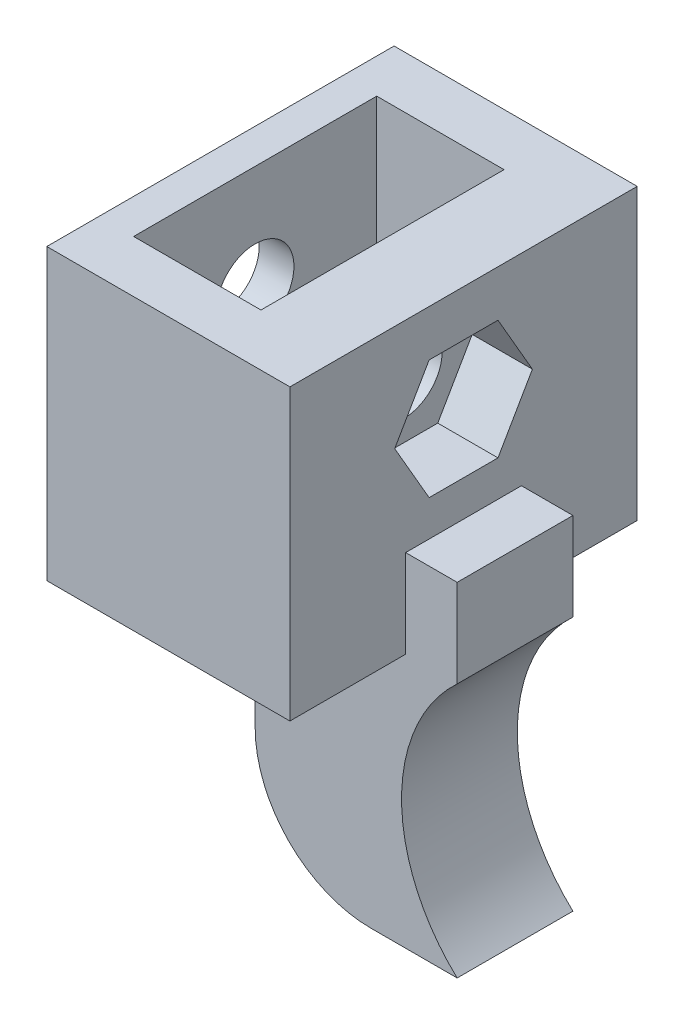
ISO-10303-21;
HEADER;
FILE_DESCRIPTION(('STEP AP214'),'2;1');
FILE_NAME('part.step','',(''),(''),'','','');
FILE_SCHEMA(('AUTOMOTIVE_DESIGN { 1 0 10303 214 1 1 1 1 }'));
ENDSEC;
DATA;
#1=APPLICATION_CONTEXT('core data for automotive mechanical design processes');
#2=APPLICATION_PROTOCOL_DEFINITION('international standard','automotive_design',2000,#1);
#3=PRODUCT_CONTEXT('',#1,'mechanical');
#4=PRODUCT('Part','Part','',(#3));
#5=PRODUCT_RELATED_PRODUCT_CATEGORY('part','',(#4));
#6=PRODUCT_DEFINITION_FORMATION('','',#4);
#7=PRODUCT_DEFINITION_CONTEXT('part definition',#1,'design');
#8=PRODUCT_DEFINITION('design','',#6,#7);
#9=PRODUCT_DEFINITION_SHAPE('','',#8);
#10=(LENGTH_UNIT() NAMED_UNIT(*) SI_UNIT(.MILLI.,.METRE.));
#11=(NAMED_UNIT(*) PLANE_ANGLE_UNIT() SI_UNIT($,.RADIAN.));
#12=(NAMED_UNIT(*) SI_UNIT($,.STERADIAN.) SOLID_ANGLE_UNIT());
#13=UNCERTAINTY_MEASURE_WITH_UNIT(LENGTH_MEASURE(1.E-05),#10,'distance_accuracy_value','');
#14=(GEOMETRIC_REPRESENTATION_CONTEXT(3) GLOBAL_UNCERTAINTY_ASSIGNED_CONTEXT((#13)) GLOBAL_UNIT_ASSIGNED_CONTEXT((#10,
#11,#12)) REPRESENTATION_CONTEXT('',''));
#15=CARTESIAN_POINT('',(0.,0.,0.));
#16=DIRECTION('',(0.,0.,1.));
#17=DIRECTION('',(1.,0.,0.));
#18=AXIS2_PLACEMENT_3D('',#15,#16,#17);
#19=CARTESIAN_POINT('',(-33.,-21.3245016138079,0.));
#20=DIRECTION('',(1.,0.,0.));
#21=DIRECTION('',(0.,0.,-1.));
#22=AXIS2_PLACEMENT_3D('',#19,#20,#21);
#23=CYLINDRICAL_SURFACE('',#22,3.35);
#24=CARTESIAN_POINT('',(-19.,-21.3245016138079,0.));
#25=DIRECTION('',(-1.,0.,0.));
#26=DIRECTION('',(0.,0.,1.));
#27=AXIS2_PLACEMENT_3D('',#24,#25,#26);
#28=CIRCLE('',#27,3.35);
#29=CARTESIAN_POINT('',(-19.,-21.3245016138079,3.35));
#30=VERTEX_POINT('',#29);
#31=EDGE_CURVE('E230',#30,#30,#28,.T.);
#32=ORIENTED_EDGE('',*,*,#31,.T.);
#33=EDGE_LOOP('',(#32));
#34=FACE_BOUND('',#33,.T.);
#35=CARTESIAN_POINT('',(-17.2,-21.3245016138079,0.));
#36=DIRECTION('',(1.,0.,0.));
#37=DIRECTION('',(0.,0.,-1.));
#38=AXIS2_PLACEMENT_3D('',#35,#36,#37);
#39=CIRCLE('',#38,3.35);
#40=CARTESIAN_POINT('',(-17.2,-21.3245016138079,-3.35));
#41=VERTEX_POINT('',#40);
#42=EDGE_CURVE('E40',#41,#41,#39,.F.);
#43=ORIENTED_EDGE('',*,*,#42,.F.);
#44=EDGE_LOOP('',(#43));
#45=FACE_BOUND('',#44,.T.);
#46=ADVANCED_FACE('F36',(#34,#45),#23,.F.);
#47=CARTESIAN_POINT('',(-15.,-49.1745016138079,-15.));
#48=DIRECTION('',(0.,0.,-1.));
#49=DIRECTION('',(-1.,0.,0.));
#50=AXIS2_PLACEMENT_3D('',#47,#48,#49);
#51=PLANE('',#50);
#52=DIRECTION('',(0.,1.,0.));
#53=VECTOR('',#52,1.);
#54=CARTESIAN_POINT('',(-12.,-12.1745016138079,-15.));
#55=LINE('',#54,#53);
#56=CARTESIAN_POINT('',(-12.,-37.1745016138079,-15.));
#57=VERTEX_POINT('',#56);
#58=CARTESIAN_POINT('',(-12.,-12.1745016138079,-15.));
#59=VERTEX_POINT('',#58);
#60=EDGE_CURVE('E307',#57,#59,#55,.T.);
#61=ORIENTED_EDGE('',*,*,#60,.F.);
#62=DIRECTION('',(1.,0.,0.));
#63=VECTOR('',#62,1.);
#64=CARTESIAN_POINT('',(-33.,-37.1745016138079,-15.));
#65=LINE('',#64,#63);
#66=CARTESIAN_POINT('',(-33.,-37.1745016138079,-15.));
#67=VERTEX_POINT('',#66);
#68=EDGE_CURVE('E303',#67,#57,#65,.T.);
#69=ORIENTED_EDGE('',*,*,#68,.F.);
#70=DIRECTION('',(0.,-1.,0.));
#71=VECTOR('',#70,1.);
#72=CARTESIAN_POINT('',(-33.,-12.1745016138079,-15.));
#73=LINE('',#72,#71);
#74=CARTESIAN_POINT('',(-33.,-12.1745016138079,-15.));
#75=VERTEX_POINT('',#74);
#76=EDGE_CURVE('E300',#75,#67,#73,.T.);
#77=ORIENTED_EDGE('',*,*,#76,.F.);
#78=DIRECTION('',(-1.,0.,0.));
#79=VECTOR('',#78,1.);
#80=CARTESIAN_POINT('',(-33.,-12.1745016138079,-15.));
#81=LINE('',#80,#79);
#82=EDGE_CURVE('E229',#59,#75,#81,.T.);
#83=ORIENTED_EDGE('',*,*,#82,.F.);
#84=EDGE_LOOP('',(#61,#69,#77,#83));
#85=FACE_BOUND('',#84,.T.);
#86=ADVANCED_FACE('F423',(#85),#51,.T.);
#87=CARTESIAN_POINT('',(-15.,-49.1745016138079,15.));
#88=DIRECTION('',(0.,0.,-1.));
#89=DIRECTION('',(-1.,0.,0.));
#90=AXIS2_PLACEMENT_3D('',#87,#88,#89);
#91=PLANE('',#90);
#92=DIRECTION('',(1.,0.,0.));
#93=VECTOR('',#92,1.);
#94=CARTESIAN_POINT('',(-33.,-37.1745016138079,15.));
#95=LINE('',#94,#93);
#96=CARTESIAN_POINT('',(-33.,-37.1745016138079,15.));
#97=VERTEX_POINT('',#96);
#98=CARTESIAN_POINT('',(-12.,-37.1745016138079,15.));
#99=VERTEX_POINT('',#98);
#100=EDGE_CURVE('E314',#97,#99,#95,.T.);
#101=ORIENTED_EDGE('',*,*,#100,.T.);
#102=DIRECTION('',(0.,1.,0.));
#103=VECTOR('',#102,1.);
#104=CARTESIAN_POINT('',(-12.,-12.1745016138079,15.));
#105=LINE('',#104,#103);
#106=CARTESIAN_POINT('',(-12.,-12.1745016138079,15.));
#107=VERTEX_POINT('',#106);
#108=EDGE_CURVE('E317',#99,#107,#105,.T.);
#109=ORIENTED_EDGE('',*,*,#108,.T.);
#110=DIRECTION('',(-1.,0.,0.));
#111=VECTOR('',#110,1.);
#112=CARTESIAN_POINT('',(-33.,-12.1745016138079,15.));
#113=LINE('',#112,#111);
#114=CARTESIAN_POINT('',(-33.,-12.1745016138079,15.));
#115=VERTEX_POINT('',#114);
#116=EDGE_CURVE('E304',#107,#115,#113,.T.);
#117=ORIENTED_EDGE('',*,*,#116,.T.);
#118=DIRECTION('',(0.,-1.,0.));
#119=VECTOR('',#118,1.);
#120=CARTESIAN_POINT('',(-33.,-12.1745016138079,15.));
#121=LINE('',#120,#119);
#122=EDGE_CURVE('E293',#115,#97,#121,.T.);
#123=ORIENTED_EDGE('',*,*,#122,.T.);
#124=EDGE_LOOP('',(#101,#109,#117,#123));
#125=FACE_BOUND('',#124,.T.);
#126=ADVANCED_FACE('F329',(#125),#91,.F.);
#127=CARTESIAN_POINT('',(-33.,-12.1745016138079,-15.));
#128=DIRECTION('',(-1.,0.,0.));
#129=DIRECTION('',(0.,-1.,0.));
#130=AXIS2_PLACEMENT_3D('',#127,#128,#129);
#131=PLANE('',#130);
#132=CARTESIAN_POINT('',(-33.,-21.3245016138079,0.));
#133=DIRECTION('',(1.,0.,0.));
#134=DIRECTION('',(0.,0.,-1.));
#135=AXIS2_PLACEMENT_3D('',#132,#133,#134);
#136=CIRCLE('',#135,3.35);
#137=CARTESIAN_POINT('',(-33.,-21.3245016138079,-3.35));
#138=VERTEX_POINT('',#137);
#139=EDGE_CURVE('E233',#138,#138,#136,.T.);
#140=ORIENTED_EDGE('',*,*,#139,.T.);
#141=EDGE_LOOP('',(#140));
#142=FACE_BOUND('',#141,.T.);
#143=ORIENTED_EDGE('',*,*,#122,.F.);
#144=DIRECTION('',(0.,0.,1.));
#145=VECTOR('',#144,1.);
#146=CARTESIAN_POINT('',(-33.,-12.1745016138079,-15.));
#147=LINE('',#146,#145);
#148=EDGE_CURVE('E11',#75,#115,#147,.T.);
#149=ORIENTED_EDGE('',*,*,#148,.F.);
#150=ORIENTED_EDGE('',*,*,#76,.T.);
#151=DIRECTION('',(0.,0.,1.));
#152=VECTOR('',#151,1.);
#153=CARTESIAN_POINT('',(-33.,-37.1745016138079,-15.));
#154=LINE('',#153,#152);
#155=EDGE_CURVE('E228',#67,#97,#154,.T.);
#156=ORIENTED_EDGE('',*,*,#155,.T.);
#157=EDGE_LOOP('',(#143,#149,#150,#156));
#158=FACE_BOUND('',#157,.T.);
#159=ADVANCED_FACE('F38',(#142,#158),#131,.T.);
#160=CARTESIAN_POINT('',(-33.,-12.1745016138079,-15.));
#161=DIRECTION('',(0.,1.,0.));
#162=DIRECTION('',(0.,0.,1.));
#163=AXIS2_PLACEMENT_3D('',#160,#161,#162);
#164=PLANE('',#163);
#165=DIRECTION('',(1.,0.,0.));
#166=VECTOR('',#165,1.);
#167=CARTESIAN_POINT('',(-30.,-12.1745016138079,10.5));
#168=LINE('',#167,#166);
#169=CARTESIAN_POINT('',(-30.,-12.1745016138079,10.5));
#170=VERTEX_POINT('',#169);
#171=CARTESIAN_POINT('',(-19.,-12.1745016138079,10.5));
#172=VERTEX_POINT('',#171);
#173=EDGE_CURVE('E269',#170,#172,#168,.T.);
#174=ORIENTED_EDGE('',*,*,#173,.F.);
#175=DIRECTION('',(0.,0.,1.));
#176=VECTOR('',#175,1.);
#177=CARTESIAN_POINT('',(-30.,-12.1745016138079,-10.5));
#178=LINE('',#177,#176);
#179=CARTESIAN_POINT('',(-30.,-12.1745016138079,-10.5));
#180=VERTEX_POINT('',#179);
#181=EDGE_CURVE('E274',#180,#170,#178,.T.);
#182=ORIENTED_EDGE('',*,*,#181,.F.);
#183=DIRECTION('',(1.,0.,0.));
#184=VECTOR('',#183,1.);
#185=CARTESIAN_POINT('',(-30.,-12.1745016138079,-10.5));
#186=LINE('',#185,#184);
#187=CARTESIAN_POINT('',(-19.,-12.1745016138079,-10.5));
#188=VERTEX_POINT('',#187);
#189=EDGE_CURVE('E286',#180,#188,#186,.T.);
#190=ORIENTED_EDGE('',*,*,#189,.T.);
#191=DIRECTION('',(0.,0.,1.));
#192=VECTOR('',#191,1.);
#193=CARTESIAN_POINT('',(-19.,-12.1745016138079,-10.5));
#194=LINE('',#193,#192);
#195=EDGE_CURVE('E283',#188,#172,#194,.T.);
#196=ORIENTED_EDGE('',*,*,#195,.T.);
#197=EDGE_LOOP('',(#174,#182,#190,#196));
#198=FACE_BOUND('',#197,.T.);
#199=ORIENTED_EDGE('',*,*,#116,.F.);
#200=DIRECTION('',(0.,0.,1.));
#201=VECTOR('',#200,1.);
#202=CARTESIAN_POINT('',(-12.,-12.1745016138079,-15.));
#203=LINE('',#202,#201);
#204=EDGE_CURVE('E45',#59,#107,#203,.T.);
#205=ORIENTED_EDGE('',*,*,#204,.F.);
#206=ORIENTED_EDGE('',*,*,#82,.T.);
#207=ORIENTED_EDGE('',*,*,#148,.T.);
#208=EDGE_LOOP('',(#199,#205,#206,#207));
#209=FACE_BOUND('',#208,.T.);
#210=ADVANCED_FACE('F331',(#198,#209),#164,.T.);
#211=CARTESIAN_POINT('',(-12.,-12.1745016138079,-15.));
#212=DIRECTION('',(1.,0.,0.));
#213=DIRECTION('',(0.,0.,-1.));
#214=AXIS2_PLACEMENT_3D('',#211,#212,#213);
#215=PLANE('',#214);
#216=DIRECTION('',(0.,0.866025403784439,-0.5));
#217=VECTOR('',#216,1.);
#218=CARTESIAN_POINT('',(-12.,-26.4745016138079,-2.97335388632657));
#219=LINE('',#218,#217);
#220=CARTESIAN_POINT('',(-12.,-26.4745016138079,-2.97335388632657));
#221=VERTEX_POINT('',#220);
#222=CARTESIAN_POINT('',(-12.,-21.3245016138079,-5.94670777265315));
#223=VERTEX_POINT('',#222);
#224=EDGE_CURVE('E61',#221,#223,#219,.T.);
#225=ORIENTED_EDGE('',*,*,#224,.F.);
#226=DIRECTION('',(0.,0.,-1.));
#227=VECTOR('',#226,1.);
#228=CARTESIAN_POINT('',(-12.,-26.4745016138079,2.97335388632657));
#229=LINE('',#228,#227);
#230=CARTESIAN_POINT('',(-12.,-26.4745016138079,2.97335388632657));
#231=VERTEX_POINT('',#230);
#232=EDGE_CURVE('E351',#231,#221,#229,.T.);
#233=ORIENTED_EDGE('',*,*,#232,.F.);
#234=DIRECTION('',(0.,-0.866025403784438,-0.5));
#235=VECTOR('',#234,1.);
#236=CARTESIAN_POINT('',(-12.,-21.3245016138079,5.94670777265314));
#237=LINE('',#236,#235);
#238=CARTESIAN_POINT('',(-12.,-21.3245016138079,5.94670777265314));
#239=VERTEX_POINT('',#238);
#240=EDGE_CURVE('E376',#239,#231,#237,.T.);
#241=ORIENTED_EDGE('',*,*,#240,.F.);
#242=DIRECTION('',(0.,-0.866025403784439,0.5));
#243=VECTOR('',#242,1.);
#244=CARTESIAN_POINT('',(-12.,-16.1745016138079,2.97335388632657));
#245=LINE('',#244,#243);
#246=CARTESIAN_POINT('',(-12.,-16.1745016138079,2.97335388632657));
#247=VERTEX_POINT('',#246);
#248=EDGE_CURVE('E373',#247,#239,#245,.T.);
#249=ORIENTED_EDGE('',*,*,#248,.F.);
#250=DIRECTION('',(0.,0.,1.));
#251=VECTOR('',#250,1.);
#252=CARTESIAN_POINT('',(-12.,-16.1745016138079,-2.97335388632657));
#253=LINE('',#252,#251);
#254=CARTESIAN_POINT('',(-12.,-16.1745016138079,-2.97335388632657));
#255=VERTEX_POINT('',#254);
#256=EDGE_CURVE('E370',#255,#247,#253,.T.);
#257=ORIENTED_EDGE('',*,*,#256,.F.);
#258=DIRECTION('',(0.,0.866025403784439,0.5));
#259=VECTOR('',#258,1.);
#260=CARTESIAN_POINT('',(-12.,-21.3245016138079,-5.94670777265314));
#261=LINE('',#260,#259);
#262=EDGE_CURVE('E367',#223,#255,#261,.T.);
#263=ORIENTED_EDGE('',*,*,#262,.F.);
#264=EDGE_LOOP('',(#225,#233,#241,#249,#257,#263));
#265=FACE_BOUND('',#264,.T.);
#266=ORIENTED_EDGE('',*,*,#108,.F.);
#267=DIRECTION('',(0.,0.,1.));
#268=VECTOR('',#267,1.);
#269=CARTESIAN_POINT('',(-12.,-37.1745016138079,15.));
#270=LINE('',#269,#268);
#271=CARTESIAN_POINT('',(-12.,-37.1745016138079,5.));
#272=VERTEX_POINT('',#271);
#273=EDGE_CURVE('E196',#272,#99,#270,.T.);
#274=ORIENTED_EDGE('',*,*,#273,.F.);
#275=DIRECTION('',(0.,1.,0.));
#276=VECTOR('',#275,1.);
#277=CARTESIAN_POINT('',(-12.,-48.1190577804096,5.));
#278=LINE('',#277,#276);
#279=CARTESIAN_POINT('',(-12.,-29.5726790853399,5.));
#280=VERTEX_POINT('',#279);
#281=EDGE_CURVE('E53',#272,#280,#278,.T.);
#282=ORIENTED_EDGE('',*,*,#281,.T.);
#283=DIRECTION('',(0.,0.,1.));
#284=VECTOR('',#283,1.);
#285=CARTESIAN_POINT('',(-12.,-29.5726790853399,-15.));
#286=LINE('',#285,#284);
#287=CARTESIAN_POINT('',(-12.,-29.5726790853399,-5.));
#288=VERTEX_POINT('',#287);
#289=EDGE_CURVE('E210',#288,#280,#286,.T.);
#290=ORIENTED_EDGE('',*,*,#289,.F.);
#291=DIRECTION('',(0.,1.,0.));
#292=VECTOR('',#291,1.);
#293=CARTESIAN_POINT('',(-12.,-48.1190577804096,-5.));
#294=LINE('',#293,#292);
#295=CARTESIAN_POINT('',(-12.,-37.1745016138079,-5.));
#296=VERTEX_POINT('',#295);
#297=EDGE_CURVE('E191',#296,#288,#294,.T.);
#298=ORIENTED_EDGE('',*,*,#297,.F.);
#299=DIRECTION('',(0.,0.,1.));
#300=VECTOR('',#299,1.);
#301=CARTESIAN_POINT('',(-12.,-37.1745016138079,-15.));
#302=LINE('',#301,#300);
#303=EDGE_CURVE('E205',#57,#296,#302,.T.);
#304=ORIENTED_EDGE('',*,*,#303,.F.);
#305=ORIENTED_EDGE('',*,*,#60,.T.);
#306=ORIENTED_EDGE('',*,*,#204,.T.);
#307=EDGE_LOOP('',(#266,#274,#282,#290,#298,#304,#305,#306));
#308=FACE_BOUND('',#307,.T.);
#309=ADVANCED_FACE('F322',(#265,#308),#215,.T.);
#310=CARTESIAN_POINT('',(-12.,-29.5726790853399,-15.));
#311=DIRECTION('',(0.,1.,0.));
#312=DIRECTION('',(0.,0.,1.));
#313=AXIS2_PLACEMENT_3D('',#310,#311,#312);
#314=PLANE('',#313);
#315=DIRECTION('',(1.,0.,0.));
#316=VECTOR('',#315,1.);
#317=CARTESIAN_POINT('',(-12.,-29.5726790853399,-5.));
#318=LINE('',#317,#316);
#319=CARTESIAN_POINT('',(-7.55215673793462,-29.5726790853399,-5.));
#320=VERTEX_POINT('',#319);
#321=EDGE_CURVE('E185',#288,#320,#318,.T.);
#322=ORIENTED_EDGE('',*,*,#321,.F.);
#323=ORIENTED_EDGE('',*,*,#289,.T.);
#324=DIRECTION('',(-1.,0.,0.));
#325=VECTOR('',#324,1.);
#326=CARTESIAN_POINT('',(-12.,-29.5726790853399,5.));
#327=LINE('',#326,#325);
#328=CARTESIAN_POINT('',(-7.55215673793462,-29.5726790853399,5.));
#329=VERTEX_POINT('',#328);
#330=EDGE_CURVE('E209',#329,#280,#327,.T.);
#331=ORIENTED_EDGE('',*,*,#330,.F.);
#332=DIRECTION('',(0.,0.,1.));
#333=VECTOR('',#332,1.);
#334=CARTESIAN_POINT('',(-7.55215673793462,-29.5726790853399,-15.));
#335=LINE('',#334,#333);
#336=EDGE_CURVE('E202',#320,#329,#335,.T.);
#337=ORIENTED_EDGE('',*,*,#336,.F.);
#338=EDGE_LOOP('',(#322,#323,#331,#337));
#339=FACE_BOUND('',#338,.T.);
#340=ADVANCED_FACE('F208',(#339),#314,.T.);
#341=CARTESIAN_POINT('',(-7.55215673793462,-29.5726790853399,-15.));
#342=DIRECTION('',(1.,0.,0.));
#343=DIRECTION('',(0.,0.,-1.));
#344=AXIS2_PLACEMENT_3D('',#341,#342,#343);
#345=PLANE('',#344);
#346=DIRECTION('',(0.,1.,0.));
#347=VECTOR('',#346,1.);
#348=CARTESIAN_POINT('',(-7.55215673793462,-48.1190577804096,-5.));
#349=LINE('',#348,#347);
#350=CARTESIAN_POINT('',(-7.55215673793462,-37.1745016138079,-5.));
#351=VERTEX_POINT('',#350);
#352=EDGE_CURVE('E188',#351,#320,#349,.T.);
#353=ORIENTED_EDGE('',*,*,#352,.T.);
#354=ORIENTED_EDGE('',*,*,#336,.T.);
#355=DIRECTION('',(0.,1.,0.));
#356=VECTOR('',#355,1.);
#357=CARTESIAN_POINT('',(-7.55215673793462,-48.1190577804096,5.));
#358=LINE('',#357,#356);
#359=CARTESIAN_POINT('',(-7.55215673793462,-37.1745016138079,5.));
#360=VERTEX_POINT('',#359);
#361=EDGE_CURVE('E341',#360,#329,#358,.T.);
#362=ORIENTED_EDGE('',*,*,#361,.F.);
#363=DIRECTION('',(0.,0.,1.));
#364=VECTOR('',#363,1.);
#365=CARTESIAN_POINT('',(-7.55215673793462,-37.1745016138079,-15.));
#366=LINE('',#365,#364);
#367=EDGE_CURVE('E204',#351,#360,#366,.T.);
#368=ORIENTED_EDGE('',*,*,#367,.F.);
#369=EDGE_LOOP('',(#353,#354,#362,#368));
#370=FACE_BOUND('',#369,.T.);
#371=ADVANCED_FACE('F201',(#370),#345,.T.);
#372=CARTESIAN_POINT('',(2.64588228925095,-48.1745016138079,-15.));
#373=DIRECTION('',(0.,0.,1.));
#374=DIRECTION('',(1.,0.,0.));
#375=AXIS2_PLACEMENT_3D('',#372,#373,#374);
#376=CYLINDRICAL_SURFACE('',#375,15.);
#377=CARTESIAN_POINT('',(2.64588228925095,-48.1745016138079,5.));
#378=DIRECTION('',(0.,0.,-1.));
#379=DIRECTION('',(-1.,0.,0.));
#380=AXIS2_PLACEMENT_3D('',#377,#378,#379);
#381=CIRCLE('',#380,15.);
#382=CARTESIAN_POINT('',(-7.55215673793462,-59.1745016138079,5.));
#383=VERTEX_POINT('',#382);
#384=EDGE_CURVE('E266',#383,#360,#381,.T.);
#385=ORIENTED_EDGE('',*,*,#384,.F.);
#386=DIRECTION('',(0.,0.,1.));
#387=VECTOR('',#386,1.);
#388=CARTESIAN_POINT('',(-7.55215673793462,-59.1745016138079,-15.));
#389=LINE('',#388,#387);
#390=CARTESIAN_POINT('',(-7.55215673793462,-59.1745016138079,-5.));
#391=VERTEX_POINT('',#390);
#392=EDGE_CURVE('E213',#391,#383,#389,.T.);
#393=ORIENTED_EDGE('',*,*,#392,.F.);
#394=CARTESIAN_POINT('',(2.64588228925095,-48.1745016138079,-5.));
#395=DIRECTION('',(0.,0.,1.));
#396=DIRECTION('',(1.,0.,0.));
#397=AXIS2_PLACEMENT_3D('',#394,#395,#396);
#398=CIRCLE('',#397,15.);
#399=EDGE_CURVE('E260',#351,#391,#398,.T.);
#400=ORIENTED_EDGE('',*,*,#399,.F.);
#401=ORIENTED_EDGE('',*,*,#367,.T.);
#402=EDGE_LOOP('',(#385,#393,#400,#401));
#403=FACE_BOUND('',#402,.T.);
#404=ADVANCED_FACE('F490',(#403),#376,.F.);
#405=CARTESIAN_POINT('',(-15.,-59.1745016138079,-15.));
#406=DIRECTION('',(0.,-1.,0.));
#407=DIRECTION('',(0.,0.,-1.));
#408=AXIS2_PLACEMENT_3D('',#405,#406,#407);
#409=PLANE('',#408);
#410=DIRECTION('',(1.,0.,0.));
#411=VECTOR('',#410,1.);
#412=CARTESIAN_POINT('',(-33.,-59.1745016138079,5.));
#413=LINE('',#412,#411);
#414=CARTESIAN_POINT('',(-15.,-59.1745016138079,5.));
#415=VERTEX_POINT('',#414);
#416=EDGE_CURVE('E249',#415,#383,#413,.T.);
#417=ORIENTED_EDGE('',*,*,#416,.F.);
#418=DIRECTION('',(0.,0.,1.));
#419=VECTOR('',#418,1.);
#420=CARTESIAN_POINT('',(-15.,-59.1745016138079,-15.));
#421=LINE('',#420,#419);
#422=CARTESIAN_POINT('',(-15.,-59.1745016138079,-5.));
#423=VERTEX_POINT('',#422);
#424=EDGE_CURVE('E219',#423,#415,#421,.T.);
#425=ORIENTED_EDGE('',*,*,#424,.F.);
#426=DIRECTION('',(-1.,0.,0.));
#427=VECTOR('',#426,1.);
#428=CARTESIAN_POINT('',(-33.,-59.1745016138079,-5.));
#429=LINE('',#428,#427);
#430=EDGE_CURVE('E237',#391,#423,#429,.T.);
#431=ORIENTED_EDGE('',*,*,#430,.F.);
#432=ORIENTED_EDGE('',*,*,#392,.T.);
#433=EDGE_LOOP('',(#417,#425,#431,#432));
#434=FACE_BOUND('',#433,.T.);
#435=ADVANCED_FACE('F493',(#434),#409,.T.);
#436=CARTESIAN_POINT('',(-15.,-49.1745016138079,-15.));
#437=DIRECTION('',(0.,0.,1.));
#438=DIRECTION('',(1.,0.,0.));
#439=AXIS2_PLACEMENT_3D('',#436,#437,#438);
#440=CYLINDRICAL_SURFACE('',#439,10.);
#441=CARTESIAN_POINT('',(-15.,-49.1745016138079,5.));
#442=DIRECTION('',(0.,0.,-1.));
#443=DIRECTION('',(-1.,0.,0.));
#444=AXIS2_PLACEMENT_3D('',#441,#442,#443);
#445=CIRCLE('',#444,10.);
#446=CARTESIAN_POINT('',(-25.,-49.1745016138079,5.));
#447=VERTEX_POINT('',#446);
#448=EDGE_CURVE('E264',#447,#415,#445,.F.);
#449=ORIENTED_EDGE('',*,*,#448,.F.);
#450=DIRECTION('',(0.,0.,1.));
#451=VECTOR('',#450,1.);
#452=CARTESIAN_POINT('',(-25.,-49.1745016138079,-15.));
#453=LINE('',#452,#451);
#454=CARTESIAN_POINT('',(-25.,-49.1745016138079,-5.));
#455=VERTEX_POINT('',#454);
#456=EDGE_CURVE('E222',#455,#447,#453,.T.);
#457=ORIENTED_EDGE('',*,*,#456,.F.);
#458=CARTESIAN_POINT('',(-15.,-49.1745016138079,-5.));
#459=DIRECTION('',(0.,0.,1.));
#460=DIRECTION('',(1.,0.,0.));
#461=AXIS2_PLACEMENT_3D('',#458,#459,#460);
#462=CIRCLE('',#461,10.);
#463=EDGE_CURVE('E258',#423,#455,#462,.F.);
#464=ORIENTED_EDGE('',*,*,#463,.F.);
#465=ORIENTED_EDGE('',*,*,#424,.T.);
#466=EDGE_LOOP('',(#449,#457,#464,#465));
#467=FACE_BOUND('',#466,.T.);
#468=ADVANCED_FACE('F497',(#467),#440,.T.);
#469=CARTESIAN_POINT('',(-25.,-37.1745016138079,-15.));
#470=DIRECTION('',(-1.,0.,0.));
#471=DIRECTION('',(0.,0.,1.));
#472=AXIS2_PLACEMENT_3D('',#469,#470,#471);
#473=PLANE('',#472);
#474=DIRECTION('',(0.,-1.,0.));
#475=VECTOR('',#474,1.);
#476=CARTESIAN_POINT('',(-25.,-37.1745016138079,5.));
#477=LINE('',#476,#475);
#478=CARTESIAN_POINT('',(-25.,-37.1745016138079,5.));
#479=VERTEX_POINT('',#478);
#480=EDGE_CURVE('E262',#479,#447,#477,.T.);
#481=ORIENTED_EDGE('',*,*,#480,.F.);
#482=DIRECTION('',(0.,0.,1.));
#483=VECTOR('',#482,1.);
#484=CARTESIAN_POINT('',(-25.,-37.1745016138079,-15.));
#485=LINE('',#484,#483);
#486=CARTESIAN_POINT('',(-25.,-37.1745016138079,-5.));
#487=VERTEX_POINT('',#486);
#488=EDGE_CURVE('E225',#487,#479,#485,.T.);
#489=ORIENTED_EDGE('',*,*,#488,.F.);
#490=DIRECTION('',(0.,1.,0.));
#491=VECTOR('',#490,1.);
#492=CARTESIAN_POINT('',(-25.,-37.1745016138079,-5.));
#493=LINE('',#492,#491);
#494=EDGE_CURVE('E254',#455,#487,#493,.T.);
#495=ORIENTED_EDGE('',*,*,#494,.F.);
#496=ORIENTED_EDGE('',*,*,#456,.T.);
#497=EDGE_LOOP('',(#481,#489,#495,#496));
#498=FACE_BOUND('',#497,.T.);
#499=ADVANCED_FACE('F501',(#498),#473,.T.);
#500=CARTESIAN_POINT('',(-33.,-37.1745016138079,-15.));
#501=DIRECTION('',(0.,-1.,0.));
#502=DIRECTION('',(0.,0.,-1.));
#503=AXIS2_PLACEMENT_3D('',#500,#501,#502);
#504=PLANE('',#503);
#505=ORIENTED_EDGE('',*,*,#303,.T.);
#506=DIRECTION('',(1.,0.,0.));
#507=VECTOR('',#506,1.);
#508=CARTESIAN_POINT('',(-33.,-37.1745016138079,-5.));
#509=LINE('',#508,#507);
#510=EDGE_CURVE('E252',#487,#296,#509,.T.);
#511=ORIENTED_EDGE('',*,*,#510,.F.);
#512=ORIENTED_EDGE('',*,*,#488,.T.);
#513=DIRECTION('',(-1.,0.,0.));
#514=VECTOR('',#513,1.);
#515=CARTESIAN_POINT('',(-33.,-37.1745016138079,5.));
#516=LINE('',#515,#514);
#517=EDGE_CURVE('E251',#272,#479,#516,.T.);
#518=ORIENTED_EDGE('',*,*,#517,.F.);
#519=ORIENTED_EDGE('',*,*,#273,.T.);
#520=ORIENTED_EDGE('',*,*,#100,.F.);
#521=ORIENTED_EDGE('',*,*,#155,.F.);
#522=ORIENTED_EDGE('',*,*,#68,.T.);
#523=EDGE_LOOP('',(#505,#511,#512,#518,#519,#520,#521,#522));
#524=FACE_BOUND('',#523,.T.);
#525=ADVANCED_FACE('F338',(#524),#504,.T.);
#526=CARTESIAN_POINT('',(-30.,-30.4745016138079,10.5));
#527=DIRECTION('',(0.,0.,1.));
#528=DIRECTION('',(1.,0.,0.));
#529=AXIS2_PLACEMENT_3D('',#526,#527,#528);
#530=PLANE('',#529);
#531=ORIENTED_EDGE('',*,*,#173,.T.);
#532=DIRECTION('',(0.,1.,0.));
#533=VECTOR('',#532,1.);
#534=CARTESIAN_POINT('',(-19.,-30.4745016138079,10.5));
#535=LINE('',#534,#533);
#536=CARTESIAN_POINT('',(-19.,-30.4745016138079,10.5));
#537=VERTEX_POINT('',#536);
#538=EDGE_CURVE('E281',#537,#172,#535,.T.);
#539=ORIENTED_EDGE('',*,*,#538,.F.);
#540=DIRECTION('',(1.,0.,0.));
#541=VECTOR('',#540,1.);
#542=CARTESIAN_POINT('',(-30.,-30.4745016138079,10.5));
#543=LINE('',#542,#541);
#544=CARTESIAN_POINT('',(-30.,-30.4745016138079,10.5));
#545=VERTEX_POINT('',#544);
#546=EDGE_CURVE('E270',#545,#537,#543,.T.);
#547=ORIENTED_EDGE('',*,*,#546,.F.);
#548=DIRECTION('',(0.,1.,0.));
#549=VECTOR('',#548,1.);
#550=CARTESIAN_POINT('',(-30.,-30.4745016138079,10.5));
#551=LINE('',#550,#549);
#552=EDGE_CURVE('E291',#545,#170,#551,.T.);
#553=ORIENTED_EDGE('',*,*,#552,.T.);
#554=EDGE_LOOP('',(#531,#539,#547,#553));
#555=FACE_BOUND('',#554,.T.);
#556=ADVANCED_FACE('F450',(#555),#530,.F.);
#557=CARTESIAN_POINT('',(-30.,-30.4745016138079,-10.5));
#558=DIRECTION('',(-1.,0.,0.));
#559=DIRECTION('',(0.,0.,1.));
#560=AXIS2_PLACEMENT_3D('',#557,#558,#559);
#561=PLANE('',#560);
#562=CARTESIAN_POINT('',(-30.,-21.3245016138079,0.));
#563=DIRECTION('',(-1.,0.,0.));
#564=DIRECTION('',(0.,0.,1.));
#565=AXIS2_PLACEMENT_3D('',#562,#563,#564);
#566=CIRCLE('',#565,3.35);
#567=CARTESIAN_POINT('',(-30.,-21.3245016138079,3.35));
#568=VERTEX_POINT('',#567);
#569=EDGE_CURVE('E232',#568,#568,#566,.T.);
#570=ORIENTED_EDGE('',*,*,#569,.T.);
#571=EDGE_LOOP('',(#570));
#572=FACE_BOUND('',#571,.T.);
#573=ORIENTED_EDGE('',*,*,#181,.T.);
#574=ORIENTED_EDGE('',*,*,#552,.F.);
#575=DIRECTION('',(0.,0.,1.));
#576=VECTOR('',#575,1.);
#577=CARTESIAN_POINT('',(-30.,-30.4745016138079,-10.5));
#578=LINE('',#577,#576);
#579=CARTESIAN_POINT('',(-30.,-30.4745016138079,-10.5));
#580=VERTEX_POINT('',#579);
#581=EDGE_CURVE('E278',#580,#545,#578,.T.);
#582=ORIENTED_EDGE('',*,*,#581,.F.);
#583=DIRECTION('',(0.,1.,0.));
#584=VECTOR('',#583,1.);
#585=CARTESIAN_POINT('',(-30.,-30.4745016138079,-10.5));
#586=LINE('',#585,#584);
#587=EDGE_CURVE('E294',#580,#180,#586,.T.);
#588=ORIENTED_EDGE('',*,*,#587,.T.);
#589=EDGE_LOOP('',(#573,#574,#582,#588));
#590=FACE_BOUND('',#589,.T.);
#591=ADVANCED_FACE('F446',(#572,#590),#561,.F.);
#592=CARTESIAN_POINT('',(-30.,-30.4745016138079,-10.5));
#593=DIRECTION('',(0.,0.,1.));
#594=DIRECTION('',(1.,0.,0.));
#595=AXIS2_PLACEMENT_3D('',#592,#593,#594);
#596=PLANE('',#595);
#597=ORIENTED_EDGE('',*,*,#189,.F.);
#598=ORIENTED_EDGE('',*,*,#587,.F.);
#599=DIRECTION('',(1.,0.,0.));
#600=VECTOR('',#599,1.);
#601=CARTESIAN_POINT('',(-30.,-30.4745016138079,-10.5));
#602=LINE('',#601,#600);
#603=CARTESIAN_POINT('',(-19.,-30.4745016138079,-10.5));
#604=VERTEX_POINT('',#603);
#605=EDGE_CURVE('E276',#580,#604,#602,.T.);
#606=ORIENTED_EDGE('',*,*,#605,.T.);
#607=DIRECTION('',(0.,1.,0.));
#608=VECTOR('',#607,1.);
#609=CARTESIAN_POINT('',(-19.,-30.4745016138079,-10.5));
#610=LINE('',#609,#608);
#611=EDGE_CURVE('E296',#604,#188,#610,.T.);
#612=ORIENTED_EDGE('',*,*,#611,.T.);
#613=EDGE_LOOP('',(#597,#598,#606,#612));
#614=FACE_BOUND('',#613,.T.);
#615=ADVANCED_FACE('F449',(#614),#596,.T.);
#616=CARTESIAN_POINT('',(-19.,-30.4745016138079,-10.5));
#617=DIRECTION('',(-1.,0.,0.));
#618=DIRECTION('',(0.,0.,1.));
#619=AXIS2_PLACEMENT_3D('',#616,#617,#618);
#620=PLANE('',#619);
#621=ORIENTED_EDGE('',*,*,#31,.F.);
#622=EDGE_LOOP('',(#621));
#623=FACE_BOUND('',#622,.T.);
#624=ORIENTED_EDGE('',*,*,#195,.F.);
#625=ORIENTED_EDGE('',*,*,#611,.F.);
#626=DIRECTION('',(0.,0.,1.));
#627=VECTOR('',#626,1.);
#628=CARTESIAN_POINT('',(-19.,-30.4745016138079,-10.5));
#629=LINE('',#628,#627);
#630=EDGE_CURVE('E273',#604,#537,#629,.T.);
#631=ORIENTED_EDGE('',*,*,#630,.T.);
#632=ORIENTED_EDGE('',*,*,#538,.T.);
#633=EDGE_LOOP('',(#624,#625,#631,#632));
#634=FACE_BOUND('',#633,.T.);
#635=ADVANCED_FACE('F462',(#623,#634),#620,.T.);
#636=CARTESIAN_POINT('',(0.,-30.4745016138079,0.));
#637=DIRECTION('',(0.,-1.,0.));
#638=DIRECTION('',(0.,0.,-1.));
#639=AXIS2_PLACEMENT_3D('',#636,#637,#638);
#640=PLANE('',#639);
#641=ORIENTED_EDGE('',*,*,#546,.T.);
#642=ORIENTED_EDGE('',*,*,#630,.F.);
#643=ORIENTED_EDGE('',*,*,#605,.F.);
#644=ORIENTED_EDGE('',*,*,#581,.T.);
#645=EDGE_LOOP('',(#641,#642,#643,#644));
#646=FACE_BOUND('',#645,.T.);
#647=ADVANCED_FACE('F467',(#646),#640,.F.);
#648=CARTESIAN_POINT('',(-33.,-9.83235965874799,5.));
#649=DIRECTION('',(0.,0.,-1.));
#650=DIRECTION('',(-1.,0.,0.));
#651=AXIS2_PLACEMENT_3D('',#648,#649,#650);
#652=PLANE('',#651);
#653=ORIENTED_EDGE('',*,*,#384,.T.);
#654=ORIENTED_EDGE('',*,*,#361,.T.);
#655=ORIENTED_EDGE('',*,*,#330,.T.);
#656=ORIENTED_EDGE('',*,*,#281,.F.);
#657=ORIENTED_EDGE('',*,*,#517,.T.);
#658=ORIENTED_EDGE('',*,*,#480,.T.);
#659=ORIENTED_EDGE('',*,*,#448,.T.);
#660=ORIENTED_EDGE('',*,*,#416,.T.);
#661=EDGE_LOOP('',(#653,#654,#655,#656,#657,#658,#659,#660));
#662=FACE_BOUND('',#661,.T.);
#663=ADVANCED_FACE('F441',(#662),#652,.F.);
#664=CARTESIAN_POINT('',(-33.,-9.83235965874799,-5.));
#665=DIRECTION('',(0.,0.,1.));
#666=DIRECTION('',(1.,0.,0.));
#667=AXIS2_PLACEMENT_3D('',#664,#665,#666);
#668=PLANE('',#667);
#669=ORIENTED_EDGE('',*,*,#399,.T.);
#670=ORIENTED_EDGE('',*,*,#430,.T.);
#671=ORIENTED_EDGE('',*,*,#463,.T.);
#672=ORIENTED_EDGE('',*,*,#494,.T.);
#673=ORIENTED_EDGE('',*,*,#510,.T.);
#674=ORIENTED_EDGE('',*,*,#297,.T.);
#675=ORIENTED_EDGE('',*,*,#321,.T.);
#676=ORIENTED_EDGE('',*,*,#352,.F.);
#677=EDGE_LOOP('',(#669,#670,#671,#672,#673,#674,#675,#676));
#678=FACE_BOUND('',#677,.T.);
#679=ADVANCED_FACE('F187',(#678),#668,.F.);
#680=ORIENTED_EDGE('',*,*,#139,.F.);
#681=EDGE_LOOP('',(#680));
#682=FACE_BOUND('',#681,.T.);
#683=ORIENTED_EDGE('',*,*,#569,.F.);
#684=EDGE_LOOP('',(#683));
#685=FACE_BOUND('',#684,.T.);
#686=ADVANCED_FACE('F425',(#682,#685),#23,.F.);
#687=CARTESIAN_POINT('',(-17.2,0.,0.));
#688=DIRECTION('',(1.,0.,0.));
#689=DIRECTION('',(0.,0.,-1.));
#690=AXIS2_PLACEMENT_3D('',#687,#688,#689);
#691=PLANE('',#690);
#692=DIRECTION('',(0.,0.866025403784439,-0.5));
#693=VECTOR('',#692,1.);
#694=CARTESIAN_POINT('',(-17.2,-26.4745016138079,-2.97335388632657));
#695=LINE('',#694,#693);
#696=CARTESIAN_POINT('',(-17.2,-26.4745016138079,-2.97335388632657));
#697=VERTEX_POINT('',#696);
#698=CARTESIAN_POINT('',(-17.2,-21.3245016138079,-5.94670777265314));
#699=VERTEX_POINT('',#698);
#700=EDGE_CURVE('E347',#697,#699,#695,.T.);
#701=ORIENTED_EDGE('',*,*,#700,.T.);
#702=DIRECTION('',(0.,0.866025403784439,0.5));
#703=VECTOR('',#702,1.);
#704=CARTESIAN_POINT('',(-17.2,-21.3245016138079,-5.94670777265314));
#705=LINE('',#704,#703);
#706=CARTESIAN_POINT('',(-17.2,-16.1745016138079,-2.97335388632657));
#707=VERTEX_POINT('',#706);
#708=EDGE_CURVE('E350',#699,#707,#705,.T.);
#709=ORIENTED_EDGE('',*,*,#708,.T.);
#710=DIRECTION('',(0.,0.,1.));
#711=VECTOR('',#710,1.);
#712=CARTESIAN_POINT('',(-17.2,-16.1745016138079,-2.97335388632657));
#713=LINE('',#712,#711);
#714=CARTESIAN_POINT('',(-17.2,-16.1745016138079,2.97335388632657));
#715=VERTEX_POINT('',#714);
#716=EDGE_CURVE('E354',#707,#715,#713,.T.);
#717=ORIENTED_EDGE('',*,*,#716,.T.);
#718=DIRECTION('',(0.,-0.866025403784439,0.5));
#719=VECTOR('',#718,1.);
#720=CARTESIAN_POINT('',(-17.2,-16.1745016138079,2.97335388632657));
#721=LINE('',#720,#719);
#722=CARTESIAN_POINT('',(-17.2,-21.3245016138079,5.94670777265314));
#723=VERTEX_POINT('',#722);
#724=EDGE_CURVE('E357',#715,#723,#721,.T.);
#725=ORIENTED_EDGE('',*,*,#724,.T.);
#726=DIRECTION('',(0.,-0.866025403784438,-0.5));
#727=VECTOR('',#726,1.);
#728=CARTESIAN_POINT('',(-17.2,-21.3245016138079,5.94670777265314));
#729=LINE('',#728,#727);
#730=CARTESIAN_POINT('',(-17.2,-26.4745016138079,2.97335388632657));
#731=VERTEX_POINT('',#730);
#732=EDGE_CURVE('E360',#723,#731,#729,.T.);
#733=ORIENTED_EDGE('',*,*,#732,.T.);
#734=DIRECTION('',(0.,0.,-1.));
#735=VECTOR('',#734,1.);
#736=CARTESIAN_POINT('',(-17.2,-26.4745016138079,2.97335388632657));
#737=LINE('',#736,#735);
#738=EDGE_CURVE('E363',#731,#697,#737,.T.);
#739=ORIENTED_EDGE('',*,*,#738,.T.);
#740=EDGE_LOOP('',(#701,#709,#717,#725,#733,#739));
#741=FACE_BOUND('',#740,.T.);
#742=ORIENTED_EDGE('',*,*,#42,.T.);
#743=EDGE_LOOP('',(#742));
#744=FACE_BOUND('',#743,.T.);
#745=ADVANCED_FACE('F406',(#741,#744),#691,.T.);
#746=CARTESIAN_POINT('',(-17.2,-26.4745016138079,-2.97335388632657));
#747=DIRECTION('',(0.,-0.5,-0.866025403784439));
#748=DIRECTION('',(0.,0.866025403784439,-0.5));
#749=AXIS2_PLACEMENT_3D('',#746,#747,#748);
#750=PLANE('',#749);
#751=ORIENTED_EDGE('',*,*,#224,.T.);
#752=DIRECTION('',(1.,0.,0.));
#753=VECTOR('',#752,1.);
#754=CARTESIAN_POINT('',(-17.2,-21.3245016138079,-5.94670777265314));
#755=LINE('',#754,#753);
#756=EDGE_CURVE('E246',#699,#223,#755,.T.);
#757=ORIENTED_EDGE('',*,*,#756,.F.);
#758=ORIENTED_EDGE('',*,*,#700,.F.);
#759=DIRECTION('',(1.,0.,0.));
#760=VECTOR('',#759,1.);
#761=CARTESIAN_POINT('',(-17.2,-26.4745016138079,-2.97335388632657));
#762=LINE('',#761,#760);
#763=EDGE_CURVE('E244',#697,#221,#762,.T.);
#764=ORIENTED_EDGE('',*,*,#763,.T.);
#765=EDGE_LOOP('',(#751,#757,#758,#764));
#766=FACE_BOUND('',#765,.T.);
#767=ADVANCED_FACE('F409',(#766),#750,.F.);
#768=CARTESIAN_POINT('',(-17.2,-26.4745016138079,2.97335388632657));
#769=DIRECTION('',(0.,-1.,0.));
#770=DIRECTION('',(0.,0.,-1.));
#771=AXIS2_PLACEMENT_3D('',#768,#769,#770);
#772=PLANE('',#771);
#773=ORIENTED_EDGE('',*,*,#232,.T.);
#774=ORIENTED_EDGE('',*,*,#763,.F.);
#775=ORIENTED_EDGE('',*,*,#738,.F.);
#776=DIRECTION('',(1.,0.,0.));
#777=VECTOR('',#776,1.);
#778=CARTESIAN_POINT('',(-17.2,-26.4745016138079,2.97335388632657));
#779=LINE('',#778,#777);
#780=EDGE_CURVE('E382',#731,#231,#779,.T.);
#781=ORIENTED_EDGE('',*,*,#780,.T.);
#782=EDGE_LOOP('',(#773,#774,#775,#781));
#783=FACE_BOUND('',#782,.T.);
#784=ADVANCED_FACE('F411',(#783),#772,.F.);
#785=CARTESIAN_POINT('',(-17.2,-21.3245016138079,5.94670777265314));
#786=DIRECTION('',(0.,-0.5,0.866025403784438));
#787=DIRECTION('',(0.,-0.866025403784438,-0.5));
#788=AXIS2_PLACEMENT_3D('',#785,#786,#787);
#789=PLANE('',#788);
#790=ORIENTED_EDGE('',*,*,#240,.T.);
#791=ORIENTED_EDGE('',*,*,#780,.F.);
#792=ORIENTED_EDGE('',*,*,#732,.F.);
#793=DIRECTION('',(1.,0.,0.));
#794=VECTOR('',#793,1.);
#795=CARTESIAN_POINT('',(-17.2,-21.3245016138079,5.94670777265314));
#796=LINE('',#795,#794);
#797=EDGE_CURVE('E384',#723,#239,#796,.T.);
#798=ORIENTED_EDGE('',*,*,#797,.T.);
#799=EDGE_LOOP('',(#790,#791,#792,#798));
#800=FACE_BOUND('',#799,.T.);
#801=ADVANCED_FACE('F413',(#800),#789,.F.);
#802=CARTESIAN_POINT('',(-17.2,-16.1745016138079,2.97335388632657));
#803=DIRECTION('',(0.,0.5,0.866025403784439));
#804=DIRECTION('',(0.,-0.866025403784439,0.5));
#805=AXIS2_PLACEMENT_3D('',#802,#803,#804);
#806=PLANE('',#805);
#807=ORIENTED_EDGE('',*,*,#248,.T.);
#808=ORIENTED_EDGE('',*,*,#797,.F.);
#809=ORIENTED_EDGE('',*,*,#724,.F.);
#810=DIRECTION('',(1.,0.,0.));
#811=VECTOR('',#810,1.);
#812=CARTESIAN_POINT('',(-17.2,-16.1745016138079,2.97335388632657));
#813=LINE('',#812,#811);
#814=EDGE_CURVE('E386',#715,#247,#813,.T.);
#815=ORIENTED_EDGE('',*,*,#814,.T.);
#816=EDGE_LOOP('',(#807,#808,#809,#815));
#817=FACE_BOUND('',#816,.T.);
#818=ADVANCED_FACE('F403',(#817),#806,.F.);
#819=CARTESIAN_POINT('',(-17.2,-16.1745016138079,-2.97335388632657));
#820=DIRECTION('',(0.,1.,0.));
#821=DIRECTION('',(0.,0.,1.));
#822=AXIS2_PLACEMENT_3D('',#819,#820,#821);
#823=PLANE('',#822);
#824=ORIENTED_EDGE('',*,*,#256,.T.);
#825=ORIENTED_EDGE('',*,*,#814,.F.);
#826=ORIENTED_EDGE('',*,*,#716,.F.);
#827=DIRECTION('',(1.,0.,0.));
#828=VECTOR('',#827,1.);
#829=CARTESIAN_POINT('',(-17.2,-16.1745016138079,-2.97335388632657));
#830=LINE('',#829,#828);
#831=EDGE_CURVE('E387',#707,#255,#830,.T.);
#832=ORIENTED_EDGE('',*,*,#831,.T.);
#833=EDGE_LOOP('',(#824,#825,#826,#832));
#834=FACE_BOUND('',#833,.T.);
#835=ADVANCED_FACE('F400',(#834),#823,.F.);
#836=CARTESIAN_POINT('',(-17.2,-21.3245016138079,-5.94670777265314));
#837=DIRECTION('',(0.,0.5,-0.866025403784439));
#838=DIRECTION('',(0.,0.866025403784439,0.5));
#839=AXIS2_PLACEMENT_3D('',#836,#837,#838);
#840=PLANE('',#839);
#841=ORIENTED_EDGE('',*,*,#262,.T.);
#842=ORIENTED_EDGE('',*,*,#831,.F.);
#843=ORIENTED_EDGE('',*,*,#708,.F.);
#844=ORIENTED_EDGE('',*,*,#756,.T.);
#845=EDGE_LOOP('',(#841,#842,#843,#844));
#846=FACE_BOUND('',#845,.T.);
#847=ADVANCED_FACE('F393',(#846),#840,.F.);
#848=CLOSED_SHELL('',(#46,#86,#126,#159,#210,#309,#340,#371,#404,#435,#468,#499,#525,#556,#591,
#615,#635,#647,#663,#679,#686,#745,#767,#784,#801,#818,#835,#847));
#849=MANIFOLD_SOLID_BREP('B2',#848);
#850=ADVANCED_BREP_SHAPE_REPRESENTATION('',(#18,#849),#14);
#851=SHAPE_DEFINITION_REPRESENTATION(#9,#850);
ENDSEC;
END-ISO-10303-21;
